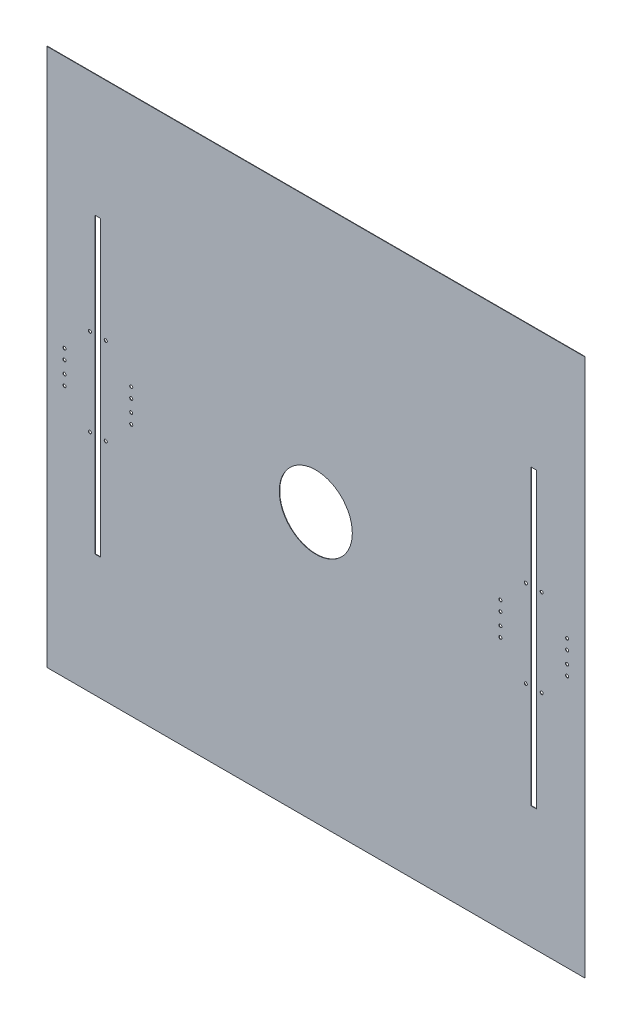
from build123d import *

# Parameters (mm, degrees)
SKETCH1_W           = 3352.8
SKETCH1_H           = 3352.8
SKETCH1_R           = 9.525
SKETCH1_R_2         = 9.675201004
SKETCH1_R_3         = 227.582044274
SKETCH1_W_2         = 35.921024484
SKETCH1_H_2         = 1828.8
BOSS_EXTRUDE1_DEPTH = 2.54


with BuildPart() as part:
    # Sketch1 → Boss-Extrude1 (new body)
    with BuildSketch(Plane.XY):
        with Locations((1659.732801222, -918.343325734)):
            Rectangle(SKETCH1_W, SKETCH1_H)
        with Locations((252.263177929, -646.907581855)):
            Circle(SKETCH1_R, mode=Mode.SUBTRACT)
        with Locations((350.688177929, -646.907581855)):
            Circle(SKETCH1_R, mode=Mode.SUBTRACT)
        with Locations((509.438177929, -816.743325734)):
            Circle(SKETCH1_R_2, mode=Mode.SUBTRACT)
        with Locations((93.513177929, -816.743325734)):
            Circle(SKETCH1_R, mode=Mode.SUBTRACT)
        with Locations((93.513177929, -880.243325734)):
            Circle(SKETCH1_R, mode=Mode.SUBTRACT)
        with Locations((93.513177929, -956.443325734)):
            Circle(SKETCH1_R, mode=Mode.SUBTRACT)
        with Locations((93.513177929, -1019.943325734)):
            Circle(SKETCH1_R, mode=Mode.SUBTRACT)
        with Locations((252.263177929, -1189.779069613)):
            Circle(SKETCH1_R, mode=Mode.SUBTRACT)
        with Locations((350.688177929, -1189.779069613)):
            Circle(SKETCH1_R, mode=Mode.SUBTRACT)
        with Locations((509.438177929, -1019.943325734)):
            Circle(SKETCH1_R, mode=Mode.SUBTRACT)
        with Locations((509.438177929, -956.443325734)):
            Circle(SKETCH1_R, mode=Mode.SUBTRACT)
        with Locations((509.438177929, -880.243325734)):
            Circle(SKETCH1_R, mode=Mode.SUBTRACT)
        with Locations((3226.022070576, -816.743325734)):
            Circle(SKETCH1_R, mode=Mode.SUBTRACT)
        with Locations((3226.022070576, -880.243325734)):
            Circle(SKETCH1_R, mode=Mode.SUBTRACT)
        with Locations((3226.022070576, -956.443325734)):
            Circle(SKETCH1_R, mode=Mode.SUBTRACT)
        with Locations((3226.022070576, -1019.943325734)):
            Circle(SKETCH1_R, mode=Mode.SUBTRACT)
        with Locations((2810.097070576, -1019.943325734)):
            Circle(SKETCH1_R, mode=Mode.SUBTRACT)
        with Locations((2810.097070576, -956.443325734)):
            Circle(SKETCH1_R, mode=Mode.SUBTRACT)
        with Locations((2810.097070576, -880.243325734)):
            Circle(SKETCH1_R, mode=Mode.SUBTRACT)
        with Locations((2810.097070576, -816.743325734)):
            Circle(SKETCH1_R, mode=Mode.SUBTRACT)
        with Locations((2968.847070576, -646.907581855)):
            Circle(SKETCH1_R, mode=Mode.SUBTRACT)
        with Locations((3067.272070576, -646.907581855)):
            Circle(SKETCH1_R, mode=Mode.SUBTRACT)
        with Locations((2968.847070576, -1189.779069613)):
            Circle(SKETCH1_R, mode=Mode.SUBTRACT)
        with Locations((3067.272070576, -1189.779069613)):
            Circle(SKETCH1_R, mode=Mode.SUBTRACT)
        with Locations((1659.732801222, -918.343325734)):
            Circle(SKETCH1_R_3, mode=Mode.SUBTRACT)
        with Locations((301.475677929, -918.343325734)):
            Rectangle(SKETCH1_W_2, SKETCH1_H_2, mode=Mode.SUBTRACT)
        with Locations((3018.059570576, -918.343325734)):
            Rectangle(SKETCH1_W_2, SKETCH1_H_2, mode=Mode.SUBTRACT)
    extrude(amount=-BOSS_EXTRUDE1_DEPTH)


solid = part.part
